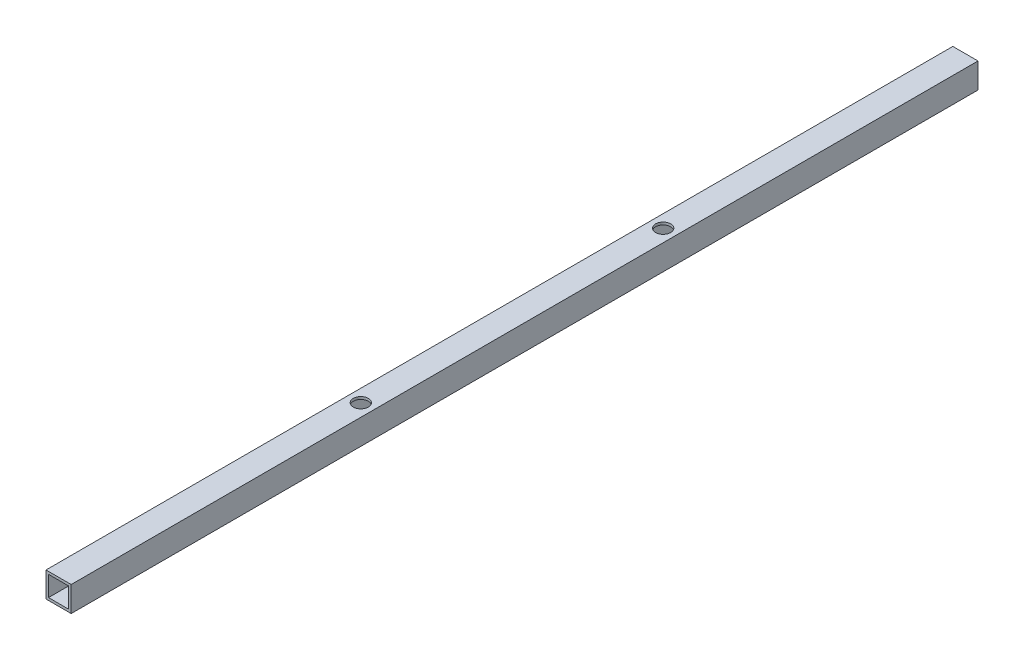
from build123d import *

# Parameters (mm, degrees)
CROQUIS2_W              = 10
CROQUIS2_H              = 10
SALIENTE_EXTRUIR1_DEPTH = 360
CROQUIS3_W              = 8
CROQUIS3_H              = 8
CORTAR_EXTRUIR1_DEPTH   = 360
CORTAR_EXTRUIR2_REACH   = 362.174
CROQUIS4_R              = 3


with BuildPart() as part:
    # Croquis2 → Saliente-Extruir1 (new body)
    with BuildSketch(Plane.XY):
        Rectangle(CROQUIS2_W, CROQUIS2_H)
    extrude(amount=SALIENTE_EXTRUIR1_DEPTH)

    # Croquis3 → Cortar-Extruir1 (cut)
    with BuildSketch(Plane.XY.offset(360)):
        Rectangle(CROQUIS3_W, CROQUIS3_H)
    extrude(amount=-CORTAR_EXTRUIR1_DEPTH, mode=Mode.SUBTRACT)

    # Croquis4 → Cortar-Extruir2 (cut, up to next)
    with BuildSketch(Plane(origin=(0, 5, 0), x_dir=(1, 0, 0), z_dir=(0, 1, 0)), mode=Mode.PRIVATE) as cortar_extruir2_sk1:
        with Locations(Location((0, -120, 0), (0, 0, 270))):
            Circle(CROQUIS4_R)
    cortar_extruir2_tool1 = extrude(cortar_extruir2_sk1.sketch, amount=-CORTAR_EXTRUIR2_REACH, mode=Mode.PRIVATE) & part.part
    # Croquis4 → Cortar-Extruir2 (cut, up to next)
    with BuildSketch(Plane(origin=(0, 5, 0), x_dir=(1, 0, 0), z_dir=(0, 1, 0)), mode=Mode.PRIVATE) as cortar_extruir2_sk2:
        with Locations(Location((0, -240, 0), (0, 0, 270))):
            Circle(CROQUIS4_R)
    cortar_extruir2_tool2 = extrude(cortar_extruir2_sk2.sketch, amount=-CORTAR_EXTRUIR2_REACH, mode=Mode.PRIVATE) & part.part
    add(cortar_extruir2_tool1.solids().sort_by_distance((0, 5, 120))[0], mode=Mode.SUBTRACT)
    add(cortar_extruir2_tool2.solids().sort_by_distance((0, 5, 240))[0], mode=Mode.SUBTRACT)


solid = part.part
